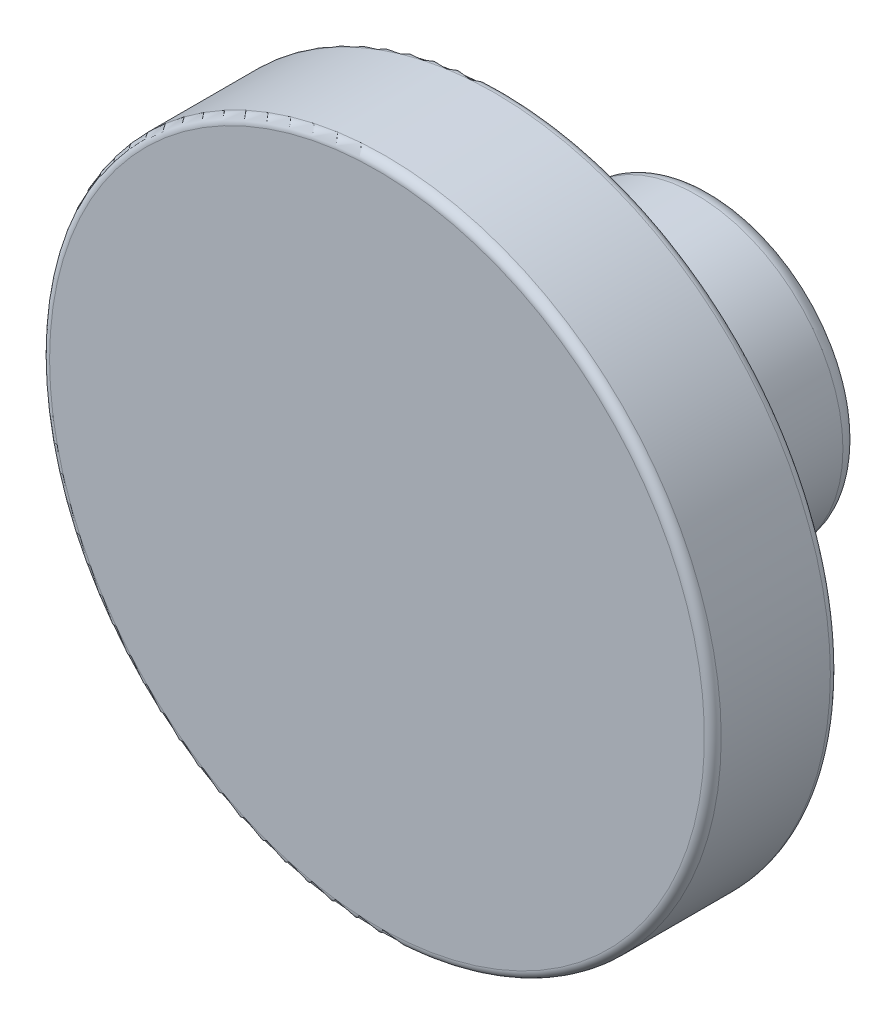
ISO-10303-21;
HEADER;
FILE_DESCRIPTION(('STEP AP214'),'2;1');
FILE_NAME('part.step','',(''),(''),'','','');
FILE_SCHEMA(('AUTOMOTIVE_DESIGN { 1 0 10303 214 1 1 1 1 }'));
ENDSEC;
DATA;
#1=APPLICATION_CONTEXT('core data for automotive mechanical design processes');
#2=APPLICATION_PROTOCOL_DEFINITION('international standard','automotive_design',2000,#1);
#3=PRODUCT_CONTEXT('',#1,'mechanical');
#4=PRODUCT('Part','Part','',(#3));
#5=PRODUCT_RELATED_PRODUCT_CATEGORY('part','',(#4));
#6=PRODUCT_DEFINITION_FORMATION('','',#4);
#7=PRODUCT_DEFINITION_CONTEXT('part definition',#1,'design');
#8=PRODUCT_DEFINITION('design','',#6,#7);
#9=PRODUCT_DEFINITION_SHAPE('','',#8);
#10=(LENGTH_UNIT() NAMED_UNIT(*) SI_UNIT(.MILLI.,.METRE.));
#11=(NAMED_UNIT(*) PLANE_ANGLE_UNIT() SI_UNIT($,.RADIAN.));
#12=(NAMED_UNIT(*) SI_UNIT($,.STERADIAN.) SOLID_ANGLE_UNIT());
#13=UNCERTAINTY_MEASURE_WITH_UNIT(LENGTH_MEASURE(1.E-05),#10,'distance_accuracy_value','');
#14=(GEOMETRIC_REPRESENTATION_CONTEXT(3) GLOBAL_UNCERTAINTY_ASSIGNED_CONTEXT((#13)) GLOBAL_UNIT_ASSIGNED_CONTEXT((#10,
#11,#12)) REPRESENTATION_CONTEXT('',''));
#15=CARTESIAN_POINT('',(0.,0.,0.));
#16=DIRECTION('',(0.,0.,1.));
#17=DIRECTION('',(1.,0.,0.));
#18=AXIS2_PLACEMENT_3D('',#15,#16,#17);
#19=CARTESIAN_POINT('',(0.,0.,45.));
#20=DIRECTION('',(0.,0.,1.));
#21=DIRECTION('',(-1.,0.,0.));
#22=AXIS2_PLACEMENT_3D('',#19,#20,#21);
#23=CYLINDRICAL_SURFACE('',#22,2.5);
#24=CARTESIAN_POINT('',(0.,0.,0.));
#25=DIRECTION('',(0.,0.,1.));
#26=DIRECTION('',(-1.,0.,0.));
#27=AXIS2_PLACEMENT_3D('',#24,#25,#26);
#28=CIRCLE('',#27,2.5);
#29=CARTESIAN_POINT('',(-2.5,0.,0.));
#30=VERTEX_POINT('',#29);
#31=EDGE_CURVE('E43',#30,#30,#28,.T.);
#32=ORIENTED_EDGE('',*,*,#31,.F.);
#33=EDGE_LOOP('',(#32));
#34=FACE_BOUND('',#33,.T.);
#35=CARTESIAN_POINT('',(0.,0.,15.));
#36=DIRECTION('',(0.,0.,1.));
#37=DIRECTION('',(1.,0.,0.));
#38=AXIS2_PLACEMENT_3D('',#35,#36,#37);
#39=CIRCLE('',#38,2.5);
#40=CARTESIAN_POINT('',(2.5,0.,15.));
#41=VERTEX_POINT('',#40);
#42=EDGE_CURVE('E46',#41,#41,#39,.T.);
#43=ORIENTED_EDGE('',*,*,#42,.T.);
#44=EDGE_LOOP('',(#43));
#45=FACE_BOUND('',#44,.T.);
#46=ADVANCED_FACE('F12',(#34,#45),#23,.F.);
#47=CARTESIAN_POINT('',(0.,0.,40.));
#48=DIRECTION('',(0.,0.,1.));
#49=DIRECTION('',(-1.,0.,0.));
#50=AXIS2_PLACEMENT_3D('',#47,#48,#49);
#51=PLANE('',#50);
#52=CARTESIAN_POINT('',(0.,0.,40.));
#53=DIRECTION('',(0.,0.,1.));
#54=DIRECTION('',(-1.,0.,0.));
#55=AXIS2_PLACEMENT_3D('',#52,#53,#54);
#56=CIRCLE('',#55,39.);
#57=CARTESIAN_POINT('',(-39.,0.,40.));
#58=VERTEX_POINT('',#57);
#59=EDGE_CURVE('E8',#58,#58,#56,.T.);
#60=ORIENTED_EDGE('',*,*,#59,.T.);
#61=EDGE_LOOP('',(#60));
#62=FACE_BOUND('',#61,.T.);
#63=ADVANCED_FACE('F63',(#62),#51,.T.);
#64=CARTESIAN_POINT('',(0.,0.,39.));
#65=DIRECTION('',(0.,0.,1.));
#66=DIRECTION('',(-1.,0.,0.));
#67=AXIS2_PLACEMENT_3D('',#64,#65,#66);
#68=TOROIDAL_SURFACE('',#67,39.,1.);
#69=CARTESIAN_POINT('',(0.,0.,39.));
#70=DIRECTION('',(0.,0.,1.));
#71=DIRECTION('',(-1.,0.,0.));
#72=AXIS2_PLACEMENT_3D('',#69,#70,#71);
#73=CIRCLE('',#72,40.);
#74=CARTESIAN_POINT('',(-40.,0.,39.));
#75=VERTEX_POINT('',#74);
#76=EDGE_CURVE('E18',#75,#75,#73,.T.);
#77=ORIENTED_EDGE('',*,*,#76,.T.);
#78=EDGE_LOOP('',(#77));
#79=FACE_BOUND('',#78,.T.);
#80=ORIENTED_EDGE('',*,*,#59,.F.);
#81=EDGE_LOOP('',(#80));
#82=FACE_BOUND('',#81,.T.);
#83=ADVANCED_FACE('F68',(#79,#82),#68,.T.);
#84=CARTESIAN_POINT('',(0.,0.,45.));
#85=DIRECTION('',(0.,0.,1.));
#86=DIRECTION('',(-1.,0.,0.));
#87=AXIS2_PLACEMENT_3D('',#84,#85,#86);
#88=CYLINDRICAL_SURFACE('',#87,40.);
#89=CARTESIAN_POINT('',(0.,0.,26.));
#90=DIRECTION('',(0.,0.,1.));
#91=DIRECTION('',(-1.,0.,0.));
#92=AXIS2_PLACEMENT_3D('',#89,#90,#91);
#93=CIRCLE('',#92,40.);
#94=CARTESIAN_POINT('',(-40.,0.,26.));
#95=VERTEX_POINT('',#94);
#96=EDGE_CURVE('E22',#95,#95,#93,.T.);
#97=ORIENTED_EDGE('',*,*,#96,.T.);
#98=EDGE_LOOP('',(#97));
#99=FACE_BOUND('',#98,.T.);
#100=ORIENTED_EDGE('',*,*,#76,.F.);
#101=EDGE_LOOP('',(#100));
#102=FACE_BOUND('',#101,.T.);
#103=ADVANCED_FACE('F74',(#99,#102),#88,.T.);
#104=CARTESIAN_POINT('',(0.,0.,26.));
#105=DIRECTION('',(0.,0.,1.));
#106=DIRECTION('',(-1.,0.,0.));
#107=AXIS2_PLACEMENT_3D('',#104,#105,#106);
#108=TOROIDAL_SURFACE('',#107,39.,1.);
#109=CARTESIAN_POINT('',(0.,0.,25.));
#110=DIRECTION('',(0.,0.,1.));
#111=DIRECTION('',(-1.,0.,0.));
#112=AXIS2_PLACEMENT_3D('',#109,#110,#111);
#113=CIRCLE('',#112,39.);
#114=CARTESIAN_POINT('',(-39.,0.,25.));
#115=VERTEX_POINT('',#114);
#116=EDGE_CURVE('E26',#115,#115,#113,.T.);
#117=ORIENTED_EDGE('',*,*,#116,.T.);
#118=EDGE_LOOP('',(#117));
#119=FACE_BOUND('',#118,.T.);
#120=ORIENTED_EDGE('',*,*,#96,.F.);
#121=EDGE_LOOP('',(#120));
#122=FACE_BOUND('',#121,.T.);
#123=ADVANCED_FACE('F79',(#119,#122),#108,.T.);
#124=CARTESIAN_POINT('',(0.,20.5,25.));
#125=DIRECTION('',(0.,0.,1.));
#126=DIRECTION('',(-1.,0.,0.));
#127=AXIS2_PLACEMENT_3D('',#124,#125,#126);
#128=PLANE('',#127);
#129=ORIENTED_EDGE('',*,*,#116,.F.);
#130=EDGE_LOOP('',(#129));
#131=FACE_BOUND('',#130,.T.);
#132=CARTESIAN_POINT('',(0.,0.,25.));
#133=DIRECTION('',(0.,0.,1.));
#134=DIRECTION('',(-1.,0.,0.));
#135=AXIS2_PLACEMENT_3D('',#132,#133,#134);
#136=CIRCLE('',#135,20.5);
#137=CARTESIAN_POINT('',(-20.5,0.,25.));
#138=VERTEX_POINT('',#137);
#139=EDGE_CURVE('E31',#138,#138,#136,.T.);
#140=ORIENTED_EDGE('',*,*,#139,.T.);
#141=EDGE_LOOP('',(#140));
#142=FACE_BOUND('',#141,.T.);
#143=ADVANCED_FACE('F83',(#131,#142),#128,.F.);
#144=CARTESIAN_POINT('',(0.,0.,22.));
#145=DIRECTION('',(0.,0.,1.));
#146=DIRECTION('',(-1.,0.,0.));
#147=AXIS2_PLACEMENT_3D('',#144,#145,#146);
#148=TOROIDAL_SURFACE('',#147,20.5,3.);
#149=ORIENTED_EDGE('',*,*,#139,.F.);
#150=EDGE_LOOP('',(#149));
#151=FACE_BOUND('',#150,.T.);
#152=CARTESIAN_POINT('',(0.,0.,22.));
#153=DIRECTION('',(0.,0.,1.));
#154=DIRECTION('',(-1.,0.,0.));
#155=AXIS2_PLACEMENT_3D('',#152,#153,#154);
#156=CIRCLE('',#155,17.5);
#157=CARTESIAN_POINT('',(-17.5,0.,22.));
#158=VERTEX_POINT('',#157);
#159=EDGE_CURVE('E34',#158,#158,#156,.T.);
#160=ORIENTED_EDGE('',*,*,#159,.T.);
#161=EDGE_LOOP('',(#160));
#162=FACE_BOUND('',#161,.T.);
#163=ADVANCED_FACE('F87',(#151,#162),#148,.F.);
#164=CARTESIAN_POINT('',(0.,0.,45.));
#165=DIRECTION('',(0.,0.,1.));
#166=DIRECTION('',(-1.,0.,0.));
#167=AXIS2_PLACEMENT_3D('',#164,#165,#166);
#168=CYLINDRICAL_SURFACE('',#167,17.5);
#169=CARTESIAN_POINT('',(0.,0.,2.));
#170=DIRECTION('',(0.,0.,1.));
#171=DIRECTION('',(-1.,0.,0.));
#172=AXIS2_PLACEMENT_3D('',#169,#170,#171);
#173=CIRCLE('',#172,17.5);
#174=CARTESIAN_POINT('',(-17.5,0.,2.));
#175=VERTEX_POINT('',#174);
#176=EDGE_CURVE('E37',#175,#175,#173,.T.);
#177=ORIENTED_EDGE('',*,*,#176,.T.);
#178=EDGE_LOOP('',(#177));
#179=FACE_BOUND('',#178,.T.);
#180=ORIENTED_EDGE('',*,*,#159,.F.);
#181=EDGE_LOOP('',(#180));
#182=FACE_BOUND('',#181,.T.);
#183=ADVANCED_FACE('F91',(#179,#182),#168,.T.);
#184=CARTESIAN_POINT('',(0.,0.,2.));
#185=DIRECTION('',(0.,0.,1.));
#186=DIRECTION('',(-1.,0.,0.));
#187=AXIS2_PLACEMENT_3D('',#184,#185,#186);
#188=TOROIDAL_SURFACE('',#187,15.5,2.);
#189=CARTESIAN_POINT('',(0.,0.,0.));
#190=DIRECTION('',(0.,0.,1.));
#191=DIRECTION('',(-1.,0.,0.));
#192=AXIS2_PLACEMENT_3D('',#189,#190,#191);
#193=CIRCLE('',#192,15.5);
#194=CARTESIAN_POINT('',(-15.5,0.,0.));
#195=VERTEX_POINT('',#194);
#196=EDGE_CURVE('E40',#195,#195,#193,.T.);
#197=ORIENTED_EDGE('',*,*,#196,.T.);
#198=EDGE_LOOP('',(#197));
#199=FACE_BOUND('',#198,.T.);
#200=ORIENTED_EDGE('',*,*,#176,.F.);
#201=EDGE_LOOP('',(#200));
#202=FACE_BOUND('',#201,.T.);
#203=ADVANCED_FACE('F59',(#199,#202),#188,.T.);
#204=CARTESIAN_POINT('',(0.,2.5,0.));
#205=DIRECTION('',(0.,0.,1.));
#206=DIRECTION('',(-1.,0.,0.));
#207=AXIS2_PLACEMENT_3D('',#204,#205,#206);
#208=PLANE('',#207);
#209=ORIENTED_EDGE('',*,*,#196,.F.);
#210=EDGE_LOOP('',(#209));
#211=FACE_BOUND('',#210,.T.);
#212=ORIENTED_EDGE('',*,*,#31,.T.);
#213=EDGE_LOOP('',(#212));
#214=FACE_BOUND('',#213,.T.);
#215=ADVANCED_FACE('F53',(#211,#214),#208,.F.);
#216=CARTESIAN_POINT('',(0.,0.,15.));
#217=DIRECTION('',(0.,0.,1.));
#218=DIRECTION('',(1.,0.,0.));
#219=AXIS2_PLACEMENT_3D('',#216,#217,#218);
#220=PLANE('',#219);
#221=ORIENTED_EDGE('',*,*,#42,.F.);
#222=EDGE_LOOP('',(#221));
#223=FACE_BOUND('',#222,.T.);
#224=ADVANCED_FACE('F51',(#223),#220,.F.);
#225=CLOSED_SHELL('',(#46,#63,#83,#103,#123,#143,#163,#183,#203,#215,#224));
#226=MANIFOLD_SOLID_BREP('B1',#225);
#227=ADVANCED_BREP_SHAPE_REPRESENTATION('',(#18,#226),#14);
#228=SHAPE_DEFINITION_REPRESENTATION(#9,#227);
ENDSEC;
END-ISO-10303-21;
